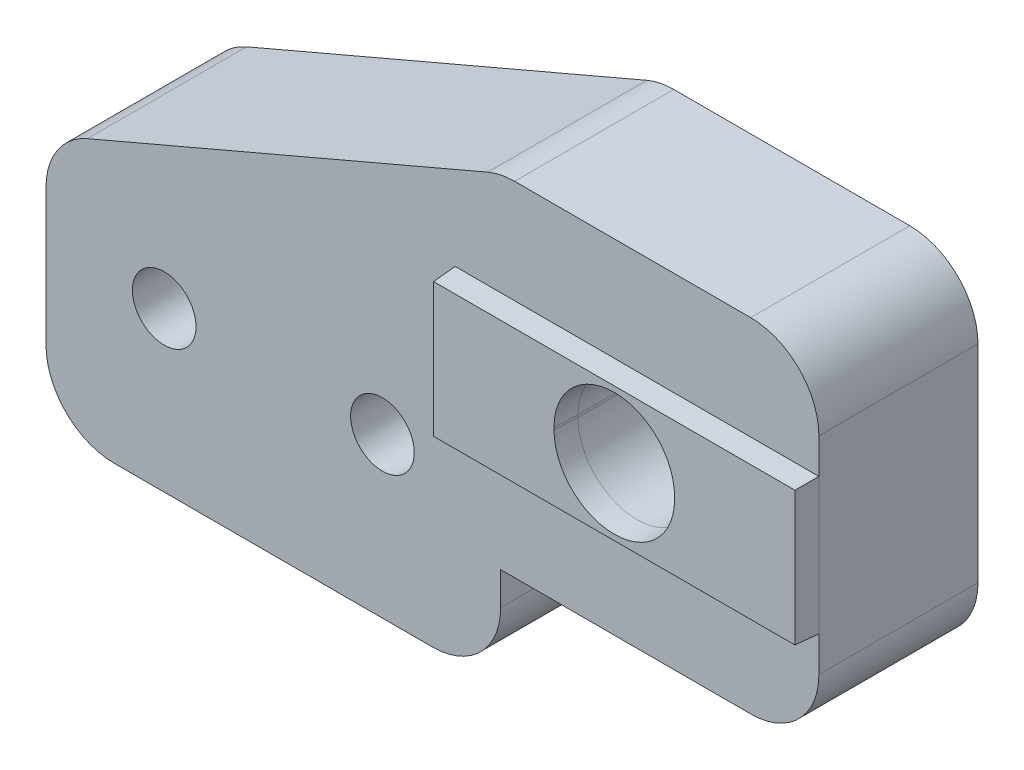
from build123d import *

# Parameters (mm, degrees)
SKETCH1_R           = 1.4
BOSS_EXTRUDE1_DEPTH = 7
CUT_EXTRUDE1_DEPTH  = 2.5
SKETCH3_W           = 16
SKETCH3_H           = 6
BOSS_EXTRUDE2_DEPTH = 1
BOSS_EXTRUDE2_DRAFT = 3


with BuildPart() as part:
    # Sketch1 → Boss-Extrude1 (new body)
    with BuildSketch(Plane.XY):
        with BuildLine():
            Line((3, 0), (17, 0))
            ThreePointArc((17, 0), (19.121320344, 0.878679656), (20, 3))
            Line((20, 3), (20, 4.45))
            Line((20, 4.45), (31, 4.45))
            ThreePointArc((31, 4.45), (33.121320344, 5.328679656), (34, 7.45))
            Line((34, 7.45), (34, 16.55))
            ThreePointArc((34, 16.55), (33.121320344, 18.671320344), (31, 19.55))
            Line((31, 19.55), (20.614357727, 19.55))
            ThreePointArc((20.614357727, 19.55), (20.012490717, 19.489005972), (19.435097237, 19.308504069))
            Line((19.435097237, 19.308504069), (1.820739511, 11.778366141))
            ThreePointArc((1.820739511, 11.778366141), (0.496224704, 10.672468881), (0, 9.019862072))
            Line((0, 9.019862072), (0, 3))
            ThreePointArc((0, 3), (0.878679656, 0.878679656), (3, 0))
        make_face()
        with Locations((5.2, 7)):
            Circle(SKETCH1_R, mode=Mode.SUBTRACT)
        with Locations((14.8, 7)):
            Circle(SKETCH1_R, mode=Mode.SUBTRACT)
        with BuildLine():
            Line((28.6, 12.05), (28.6, 11.95))
            ThreePointArc((28.6, 11.95), (26, 9.35), (23.4, 11.95))
            Line((23.4, 11.95), (23.4, 12.05))
            ThreePointArc((23.4, 12.05), (26, 14.65), (28.6, 12.05))
        make_face(mode=Mode.SUBTRACT)
    extrude(amount=BOSS_EXTRUDE1_DEPTH)

    # Sketch2 → Cut-Extrude1 (cut)
    with BuildSketch(Plane(origin=(0, 0, 0), x_dir=(-1, 0, 0), z_dir=(0, 0, -1))):
        with BuildLine():
            Line((-21.25, 12.05), (-21.25, 11.95))
            ThreePointArc((-21.25, 11.95), (-26, 7.2), (-30.75, 11.95))
            Line((-30.75, 11.95), (-30.75, 12.05))
            ThreePointArc((-30.75, 12.05), (-26, 16.8), (-21.25, 12.05))
        make_face()
    extrude(amount=-CUT_EXTRUDE1_DEPTH, mode=Mode.SUBTRACT)


with BuildPart() as boss_extrude2_tool:
    # Sketch3 → Boss-Extrude2 (with draft: the straight prism first)
    with BuildSketch(Plane.XY.offset(7)):
        with Locations((26, 12)):
            Rectangle(SKETCH3_W, SKETCH3_H)
        with BuildLine():
            Line((28.6, 12.05), (28.6, 11.95))
            ThreePointArc((28.6, 11.95), (26, 9.35), (23.4, 11.95))
            Line((23.4, 11.95), (23.4, 12.05))
            ThreePointArc((23.4, 12.05), (26, 14.65), (28.6, 12.05))
        make_face(mode=Mode.SUBTRACT)
    extrude(amount=BOSS_EXTRUDE2_DEPTH)
    # Boss-Extrude2: the draft: its side faces are tilted about the plane it starts from
    boss_extrude2_sides = [boss_extrude2_tool.faces().sort_by_distance(p)[0] for p in [
        (26, 15, 7.5),
        (18, 12, 7.5),
        (26, 9, 7.5),
        (34, 12, 7.5),
        (26, 14.65, 7.5),
        (28.6, 12, 7.5),
        (26, 9.35, 7.5),
        (23.4, 12, 7.5),
    ]]
    draft(boss_extrude2_sides, Plane.XY.offset(7), BOSS_EXTRUDE2_DRAFT)


with BuildPart() as part_1:
    add(part.part)

    # Boss-Extrude2: add boss_extrude2_tool
    add(boss_extrude2_tool.part)


solid = part_1.part
